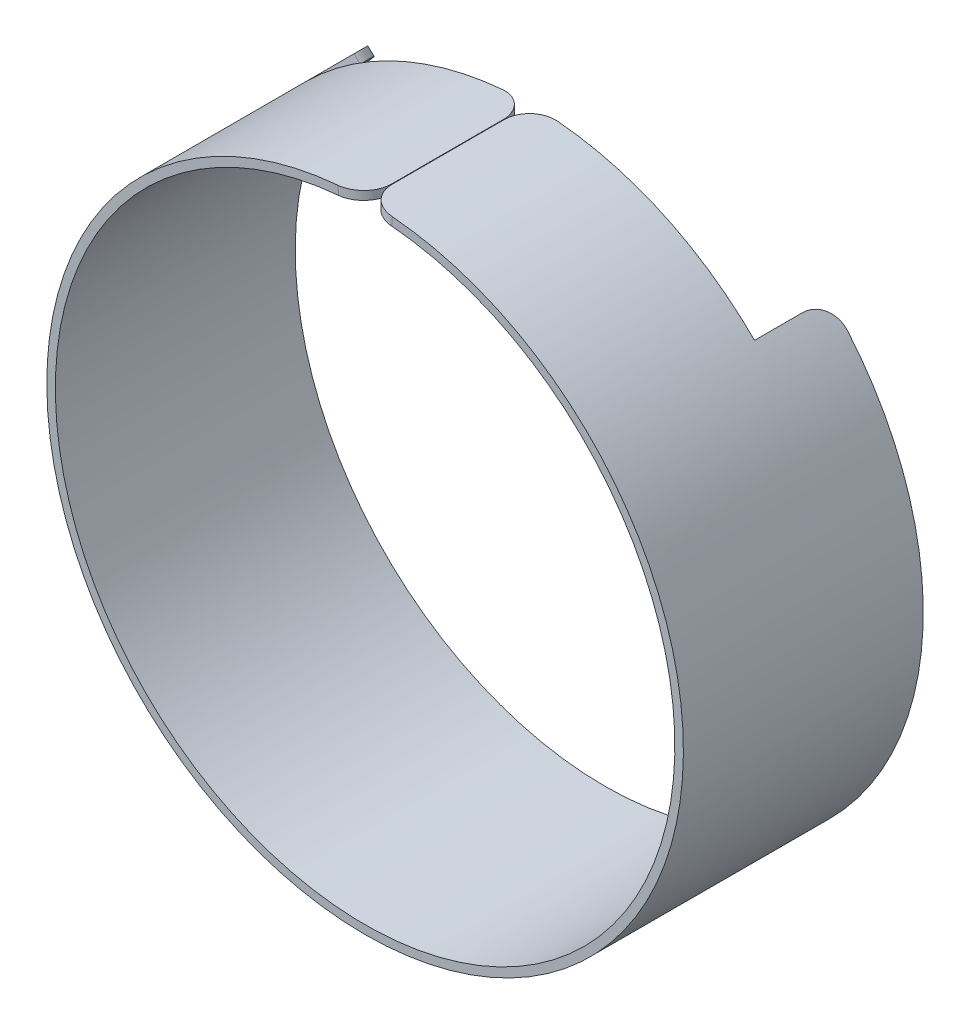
ISO-10303-21;
HEADER;
FILE_DESCRIPTION(('STEP AP214'),'2;1');
FILE_NAME('part.step','',(''),(''),'','','');
FILE_SCHEMA(('AUTOMOTIVE_DESIGN { 1 0 10303 214 1 1 1 1 }'));
ENDSEC;
DATA;
#1=APPLICATION_CONTEXT('core data for automotive mechanical design processes');
#2=APPLICATION_PROTOCOL_DEFINITION('international standard','automotive_design',2000,#1);
#3=PRODUCT_CONTEXT('',#1,'mechanical');
#4=PRODUCT('Part','Part','',(#3));
#5=PRODUCT_RELATED_PRODUCT_CATEGORY('part','',(#4));
#6=PRODUCT_DEFINITION_FORMATION('','',#4);
#7=PRODUCT_DEFINITION_CONTEXT('part definition',#1,'design');
#8=PRODUCT_DEFINITION('design','',#6,#7);
#9=PRODUCT_DEFINITION_SHAPE('','',#8);
#10=(LENGTH_UNIT() NAMED_UNIT(*) SI_UNIT(.MILLI.,.METRE.));
#11=(NAMED_UNIT(*) PLANE_ANGLE_UNIT() SI_UNIT($,.RADIAN.));
#12=(NAMED_UNIT(*) SI_UNIT($,.STERADIAN.) SOLID_ANGLE_UNIT());
#13=UNCERTAINTY_MEASURE_WITH_UNIT(LENGTH_MEASURE(1.E-05),#10,'distance_accuracy_value','');
#14=(GEOMETRIC_REPRESENTATION_CONTEXT(3) GLOBAL_UNCERTAINTY_ASSIGNED_CONTEXT((#13)) GLOBAL_UNIT_ASSIGNED_CONTEXT((#10,
#11,#12)) REPRESENTATION_CONTEXT('',''));
#15=CARTESIAN_POINT('',(0.,0.,0.));
#16=DIRECTION('',(0.,0.,1.));
#17=DIRECTION('',(1.,0.,0.));
#18=AXIS2_PLACEMENT_3D('',#15,#16,#17);
#19=CARTESIAN_POINT('',(-5.11163381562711,59.4930524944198,14.0000000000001));
#20=CARTESIAN_POINT('',(-4.45063932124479,59.5499569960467,13.9996877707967));
#21=CARTESIAN_POINT('',(-3.78914685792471,59.5950776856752,14.1300864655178));
#22=CARTESIAN_POINT('',(-2.56484583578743,59.6602582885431,14.6311182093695));
#23=CARTESIAN_POINT('',(-2.00313816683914,59.6805170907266,15.00160720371));
#24=CARTESIAN_POINT('',(-1.06522984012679,59.7045468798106,15.9273249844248));
#25=CARTESIAN_POINT('',(-0.689624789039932,59.7088278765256,16.4818419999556));
#26=CARTESIAN_POINT('',(-0.181908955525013,59.7124801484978,17.6913236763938));
#27=CARTESIAN_POINT('',(-0.0496176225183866,59.7121395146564,18.3451984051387));
#28=CARTESIAN_POINT('',(-0.0499999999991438,59.71222316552,19.0000000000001));
#29=CARTESIAN_POINT('',(-4.97466669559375,57.8989257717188,14.0000000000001));
#30=CARTESIAN_POINT('',(-4.33138366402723,57.9543055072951,13.9996877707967));
#31=CARTESIAN_POINT('',(-3.687616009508,57.9982171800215,14.1300864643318));
#32=CARTESIAN_POINT('',(-2.49612034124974,58.0616512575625,14.6311182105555));
#33=CARTESIAN_POINT('',(-1.94946373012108,58.0813672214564,15.0016072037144));
#34=CARTESIAN_POINT('',(-1.03668682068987,58.1047531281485,15.9273249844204));
#35=CARTESIAN_POINT('',(-0.671146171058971,58.10891941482,16.4818420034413));
#36=CARTESIAN_POINT('',(-0.177034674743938,58.1124738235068,17.691323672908));
#37=CARTESIAN_POINT('',(-0.048288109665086,58.1121423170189,18.3451984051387));
#38=CARTESIAN_POINT('',(-0.0486602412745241,58.112223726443,19.0000000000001));
#39=B_SPLINE_SURFACE_WITH_KNOTS('',1,3,((#19,#20,#21,#22,#23,#24,#25,#26,#27,#28),(#29,#30,#31,
#32,#33,#34,#35,#36,#37,#38)),.UNSPECIFIED.,.F.,.F.,.F.,(2,2),(4,2,2,2,4),(0.,1.),(0.,0.25,0.5,
0.75,1.),.UNSPECIFIED.);
#40=CARTESIAN_POINT('',(-0.0499999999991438,59.71222316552,19.0000000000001));
#41=CARTESIAN_POINT('',(-0.0486602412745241,58.112223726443,19.0000000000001));
#42=B_SPLINE_CURVE_WITH_KNOTS('',1,(#40,#41),.UNSPECIFIED.,.F.,.F.,(2,2),(0.,1.),.UNSPECIFIED.);
#43=CARTESIAN_POINT('',(-0.0486602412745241,58.112223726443,19.0000000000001));
#44=VERTEX_POINT('',#43);
#45=CARTESIAN_POINT('',(-0.0499999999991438,59.71222316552,19.0000000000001));
#46=VERTEX_POINT('',#45);
#47=EDGE_CURVE('E11',#44,#46,#42,.F.);
#48=CARTESIAN_POINT('',(-0.0486602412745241,58.112223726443,19.0000000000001));
#49=CARTESIAN_POINT('',(-0.048288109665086,58.1121423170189,18.3451984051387));
#50=CARTESIAN_POINT('',(-0.177034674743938,58.1124738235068,17.691323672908));
#51=CARTESIAN_POINT('',(-0.671146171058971,58.10891941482,16.4818420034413));
#52=CARTESIAN_POINT('',(-1.03668682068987,58.1047531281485,15.9273249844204));
#53=CARTESIAN_POINT('',(-1.94946373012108,58.0813672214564,15.0016072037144));
#54=CARTESIAN_POINT('',(-2.49612034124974,58.0616512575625,14.6311182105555));
#55=CARTESIAN_POINT('',(-3.687616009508,57.9982171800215,14.1300864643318));
#56=CARTESIAN_POINT('',(-4.33138366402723,57.9543055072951,13.9996877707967));
#57=CARTESIAN_POINT('',(-4.97466669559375,57.8989257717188,14.0000000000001));
#58=B_SPLINE_CURVE_WITH_KNOTS('',3,(#48,#49,#50,#51,#52,#53,#54,#55,#56,#57),.UNSPECIFIED.,.F.,
.F.,(4,2,2,2,4),(0.,0.25,0.5,0.75,1.),.UNSPECIFIED.);
#59=CARTESIAN_POINT('',(-4.97466669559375,57.8989257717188,14.0000000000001));
#60=VERTEX_POINT('',#59);
#61=EDGE_CURVE('E665',#60,#44,#58,.F.);
#62=CARTESIAN_POINT('',(-4.97466669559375,57.8989257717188,14.0000000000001));
#63=CARTESIAN_POINT('',(-5.11163381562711,59.4930524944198,14.0000000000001));
#64=B_SPLINE_CURVE_WITH_KNOTS('',1,(#62,#63),.UNSPECIFIED.,.F.,.F.,(2,2),(0.,1.),.UNSPECIFIED.);
#65=CARTESIAN_POINT('',(-5.11163381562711,59.4930524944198,14.0000000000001));
#66=VERTEX_POINT('',#65);
#67=EDGE_CURVE('E43',#60,#66,#64,.T.);
#68=CARTESIAN_POINT('',(-5.11163381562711,59.4930524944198,14.0000000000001));
#69=CARTESIAN_POINT('',(-4.45063932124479,59.5499569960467,13.9996877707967));
#70=CARTESIAN_POINT('',(-3.78914685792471,59.5950776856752,14.1300864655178));
#71=CARTESIAN_POINT('',(-2.56484583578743,59.6602582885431,14.6311182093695));
#72=CARTESIAN_POINT('',(-2.00313816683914,59.6805170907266,15.00160720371));
#73=CARTESIAN_POINT('',(-1.06522984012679,59.7045468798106,15.9273249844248));
#74=CARTESIAN_POINT('',(-0.689624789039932,59.7088278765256,16.4818419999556));
#75=CARTESIAN_POINT('',(-0.181908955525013,59.7124801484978,17.6913236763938));
#76=CARTESIAN_POINT('',(-0.0496176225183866,59.7121395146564,18.3451984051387));
#77=CARTESIAN_POINT('',(-0.0499999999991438,59.71222316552,19.0000000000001));
#78=B_SPLINE_CURVE_WITH_KNOTS('',3,(#68,#69,#70,#71,#72,#73,#74,#75,#76,#77),.UNSPECIFIED.,.F.,
.F.,(4,2,2,2,4),(0.,0.25,0.5,0.75,1.),.UNSPECIFIED.);
#79=EDGE_CURVE('E635',#66,#46,#78,.T.);
#80=ORIENTED_EDGE('',*,*,#47,.F.);
#81=ORIENTED_EDGE('',*,*,#61,.F.);
#82=ORIENTED_EDGE('',*,*,#67,.T.);
#83=ORIENTED_EDGE('',*,*,#79,.T.);
#84=EDGE_LOOP('',(#80,#81,#82,#83));
#85=FACE_BOUND('',#84,.T.);
#86=ADVANCED_FACE('F32',(#85),#39,.F.);
#87=CARTESIAN_POINT('',(0.,0.,14.0000000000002));
#88=DIRECTION('',(0.,0.,-1.));
#89=DIRECTION('',(-1.,0.,0.));
#90=AXIS2_PLACEMENT_3D('',#87,#88,#89);
#91=PLANE('',#90);
#92=ORIENTED_EDGE('',*,*,#67,.F.);
#93=CARTESIAN_POINT('',(0.,0.,14.0000000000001));
#94=DIRECTION('',(0.,0.,1.));
#95=DIRECTION('',(1.,0.,0.));
#96=AXIS2_PLACEMENT_3D('',#93,#94,#95);
#97=CIRCLE('',#96,58.1122440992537);
#98=CARTESIAN_POINT('',(-40.9376579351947,41.2448915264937,14.0000000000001));
#99=VERTEX_POINT('',#98);
#100=EDGE_CURVE('E237',#60,#99,#97,.T.);
#101=ORIENTED_EDGE('',*,*,#100,.T.);
#102=DIRECTION('',(-0.704458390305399,0.709745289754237,0.));
#103=VECTOR('',#102,1.);
#104=CARTESIAN_POINT('',(-41.5012246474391,41.8126877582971,14.0000000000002));
#105=LINE('',#104,#103);
#106=CARTESIAN_POINT('',(-42.0647913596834,42.3804839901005,14.0000000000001));
#107=VERTEX_POINT('',#106);
#108=EDGE_CURVE('E318',#99,#107,#105,.T.);
#109=ORIENTED_EDGE('',*,*,#108,.T.);
#110=CARTESIAN_POINT('',(0.,0.,14.0000000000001));
#111=DIRECTION('',(0.,0.,1.));
#112=DIRECTION('',(1.,0.,0.));
#113=AXIS2_PLACEMENT_3D('',#110,#111,#112);
#114=CIRCLE('',#113,59.7122440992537);
#115=EDGE_CURVE('E644',#66,#107,#114,.T.);
#116=ORIENTED_EDGE('',*,*,#115,.F.);
#117=EDGE_LOOP('',(#92,#101,#109,#116));
#118=FACE_BOUND('',#117,.T.);
#119=ADVANCED_FACE('F342',(#118),#91,.T.);
#120=CARTESIAN_POINT('',(-41.5012246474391,41.8126877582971,5.00000000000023));
#121=DIRECTION('',(-0.709745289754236,-0.7044583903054,0.));
#122=DIRECTION('',(0.,0.,1.));
#123=AXIS2_PLACEMENT_3D('',#120,#121,#122);
#124=PLANE('',#123);
#125=ORIENTED_EDGE('',*,*,#108,.F.);
#126=DIRECTION('',(0.,0.,1.));
#127=VECTOR('',#126,1.);
#128=CARTESIAN_POINT('',(-40.937657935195,41.2448915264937,-372.789997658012));
#129=LINE('',#128,#127);
#130=CARTESIAN_POINT('',(-40.9376579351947,41.2448915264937,5.));
#131=VERTEX_POINT('',#130);
#132=EDGE_CURVE('E235',#131,#99,#129,.T.);
#133=ORIENTED_EDGE('',*,*,#132,.F.);
#134=CARTESIAN_POINT('',(-42.0647913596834,42.3804839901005,5.00000000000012));
#135=CARTESIAN_POINT('',(-40.9376579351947,41.2448915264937,5.00000000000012));
#136=B_SPLINE_CURVE_WITH_KNOTS('',1,(#134,#135),.UNSPECIFIED.,.F.,.F.,(2,2),(0.,1.),.UNSPECIFIED.);
#137=CARTESIAN_POINT('',(-42.0647913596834,42.3804839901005,5.));
#138=VERTEX_POINT('',#137);
#139=EDGE_CURVE('E305',#131,#138,#136,.F.);
#140=ORIENTED_EDGE('',*,*,#139,.T.);
#141=DIRECTION('',(0.,0.,1.));
#142=VECTOR('',#141,1.);
#143=CARTESIAN_POINT('',(-42.0647913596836,42.3804839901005,-372.789997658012));
#144=LINE('',#143,#142);
#145=EDGE_CURVE('E646',#138,#107,#144,.T.);
#146=ORIENTED_EDGE('',*,*,#145,.T.);
#147=EDGE_LOOP('',(#125,#133,#140,#146));
#148=FACE_BOUND('',#147,.T.);
#149=ADVANCED_FACE('F262',(#148),#124,.F.);
#150=CARTESIAN_POINT('',(-45.5059802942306,38.6620984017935,1.11022302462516E-13));
#151=CARTESIAN_POINT('',(-45.0765058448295,39.1677697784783,-0.000312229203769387));
#152=CARTESIAN_POINT('',(-44.6383834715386,39.6654212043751,0.13008646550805));
#153=CARTESIAN_POINT('',(-43.814597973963,40.5734624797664,0.631118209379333));
#154=CARTESIAN_POINT('',(-43.4298568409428,40.9832187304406,1.00160720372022));
#155=CARTESIAN_POINT('',(-42.7805415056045,41.6604476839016,1.9273249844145));
#156=CARTESIAN_POINT('',(-42.5167493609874,41.9278634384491,2.48184199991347));
#157=CARTESIAN_POINT('',(-42.1586717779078,42.2878205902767,3.69132367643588));
#158=CARTESIAN_POINT('',(-42.0644608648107,42.3806937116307,4.34519840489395));
#159=CARTESIAN_POINT('',(-42.0647913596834,42.3804839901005,5.00000000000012));
#160=CARTESIAN_POINT('',(-44.2866396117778,37.6261407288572,1.11022302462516E-13));
#161=CARTESIAN_POINT('',(-43.8686730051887,38.1182625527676,-0.000312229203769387));
#162=CARTESIAN_POINT('',(-43.4422901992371,38.602579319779,0.130086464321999));
#163=CARTESIAN_POINT('',(-42.6405781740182,39.4862894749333,0.631118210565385));
#164=CARTESIAN_POINT('',(-42.2661462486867,39.8850662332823,1.00160720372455));
#165=CARTESIAN_POINT('',(-41.6342294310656,40.5441487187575,1.92732498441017));
#166=CARTESIAN_POINT('',(-41.3775056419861,40.8043990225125,2.48184200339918));
#167=CARTESIAN_POINT('',(-41.0290228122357,41.1547110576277,3.69132367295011));
#168=CARTESIAN_POINT('',(-40.9373362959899,41.2450956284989,4.34519840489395));
#169=CARTESIAN_POINT('',(-40.9376579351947,41.2448915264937,5.00000000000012));
#170=B_SPLINE_SURFACE_WITH_KNOTS('',1,3,((#150,#151,#152,#153,#154,#155,#156,#157,#158,#159),
(#160,#161,#162,#163,#164,#165,#166,#167,#168,#169)),.UNSPECIFIED.,.F.,.F.,.F.,(2,2),(4,2,2,2,
4),(0.,1.),(0.,0.25,0.5,0.75,1.),.UNSPECIFIED.);
#171=CARTESIAN_POINT('',(-40.9376579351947,41.2448915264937,5.00000000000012));
#172=CARTESIAN_POINT('',(-40.9373362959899,41.2450956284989,4.34519840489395));
#173=CARTESIAN_POINT('',(-41.0290228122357,41.1547110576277,3.69132367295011));
#174=CARTESIAN_POINT('',(-41.3775056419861,40.8043990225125,2.48184200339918));
#175=CARTESIAN_POINT('',(-41.6342294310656,40.5441487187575,1.92732498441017));
#176=CARTESIAN_POINT('',(-42.2661462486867,39.8850662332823,1.00160720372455));
#177=CARTESIAN_POINT('',(-42.6405781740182,39.4862894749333,0.631118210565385));
#178=CARTESIAN_POINT('',(-43.4422901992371,38.602579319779,0.130086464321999));
#179=CARTESIAN_POINT('',(-43.8686730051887,38.1182625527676,-0.000312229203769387));
#180=CARTESIAN_POINT('',(-44.2866396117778,37.6261407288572,1.11022302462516E-13));
#181=B_SPLINE_CURVE_WITH_KNOTS('',3,(#171,#172,#173,#174,#175,#176,#177,#178,#179,#180),
.UNSPECIFIED.,.F.,.F.,(4,2,2,2,4),(0.,0.25,0.5,0.75,1.),.UNSPECIFIED.);
#182=CARTESIAN_POINT('',(-44.2866396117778,37.6261407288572,1.11022302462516E-13));
#183=VERTEX_POINT('',#182);
#184=EDGE_CURVE('E232',#183,#131,#181,.F.);
#185=CARTESIAN_POINT('',(-44.2866396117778,37.6261407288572,1.11022302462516E-13));
#186=CARTESIAN_POINT('',(-45.5059802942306,38.6620984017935,1.11022302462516E-13));
#187=B_SPLINE_CURVE_WITH_KNOTS('',1,(#185,#186),.UNSPECIFIED.,.F.,.F.,(2,2),(0.,1.),.UNSPECIFIED.);
#188=CARTESIAN_POINT('',(-45.5059802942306,38.6620984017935,1.11022302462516E-13));
#189=VERTEX_POINT('',#188);
#190=EDGE_CURVE('E292',#183,#189,#187,.T.);
#191=CARTESIAN_POINT('',(-45.5059802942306,38.6620984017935,1.11022302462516E-13));
#192=CARTESIAN_POINT('',(-45.0765058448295,39.1677697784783,-0.000312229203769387));
#193=CARTESIAN_POINT('',(-44.6383834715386,39.6654212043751,0.13008646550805));
#194=CARTESIAN_POINT('',(-43.814597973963,40.5734624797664,0.631118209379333));
#195=CARTESIAN_POINT('',(-43.4298568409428,40.9832187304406,1.00160720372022));
#196=CARTESIAN_POINT('',(-42.7805415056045,41.6604476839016,1.9273249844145));
#197=CARTESIAN_POINT('',(-42.5167493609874,41.9278634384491,2.48184199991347));
#198=CARTESIAN_POINT('',(-42.1586717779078,42.2878205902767,3.69132367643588));
#199=CARTESIAN_POINT('',(-42.0644608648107,42.3806937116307,4.34519840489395));
#200=CARTESIAN_POINT('',(-42.0647913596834,42.3804839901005,5.00000000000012));
#201=B_SPLINE_CURVE_WITH_KNOTS('',3,(#191,#192,#193,#194,#195,#196,#197,#198,#199,#200),
.UNSPECIFIED.,.F.,.F.,(4,2,2,2,4),(0.,0.25,0.5,0.75,1.),.UNSPECIFIED.);
#202=EDGE_CURVE('E243',#189,#138,#201,.T.);
#203=ORIENTED_EDGE('',*,*,#139,.F.);
#204=ORIENTED_EDGE('',*,*,#184,.F.);
#205=ORIENTED_EDGE('',*,*,#190,.T.);
#206=ORIENTED_EDGE('',*,*,#202,.T.);
#207=EDGE_LOOP('',(#203,#204,#205,#206));
#208=FACE_BOUND('',#207,.T.);
#209=ADVANCED_FACE('F249',(#208),#170,.F.);
#210=CARTESIAN_POINT('',(0.,0.,0.));
#211=DIRECTION('',(0.,0.,1.));
#212=DIRECTION('',(0.,-1.,0.));
#213=AXIS2_PLACEMENT_3D('',#210,#211,#212);
#214=PLANE('',#213);
#215=ORIENTED_EDGE('',*,*,#190,.F.);
#216=CARTESIAN_POINT('',(0.,0.,-2.22044604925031E-13));
#217=DIRECTION('',(0.,0.,1.));
#218=DIRECTION('',(1.,0.,0.));
#219=AXIS2_PLACEMENT_3D('',#216,#217,#218);
#220=CIRCLE('',#219,58.1122440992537);
#221=CARTESIAN_POINT('',(44.2866396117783,37.6261407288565,-2.22044604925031E-13));
#222=VERTEX_POINT('',#221);
#223=EDGE_CURVE('E498',#222,#183,#220,.F.);
#224=ORIENTED_EDGE('',*,*,#223,.F.);
#225=CARTESIAN_POINT('',(45.5059802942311,38.6620984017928,-1.11022302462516E-13));
#226=CARTESIAN_POINT('',(44.2866396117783,37.6261407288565,-1.11022302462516E-13));
#227=B_SPLINE_CURVE_WITH_KNOTS('',1,(#225,#226),.UNSPECIFIED.,.F.,.F.,(2,2),(0.,1.),.UNSPECIFIED.);
#228=CARTESIAN_POINT('',(45.5059802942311,38.6620984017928,-2.22044604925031E-13));
#229=VERTEX_POINT('',#228);
#230=EDGE_CURVE('E471',#222,#229,#227,.F.);
#231=ORIENTED_EDGE('',*,*,#230,.T.);
#232=CARTESIAN_POINT('',(0.,0.,-2.22044604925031E-13));
#233=DIRECTION('',(0.,0.,1.));
#234=DIRECTION('',(1.,0.,0.));
#235=AXIS2_PLACEMENT_3D('',#232,#233,#234);
#236=CIRCLE('',#235,59.7122440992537);
#237=EDGE_CURVE('E517',#229,#189,#236,.F.);
#238=ORIENTED_EDGE('',*,*,#237,.T.);
#239=EDGE_LOOP('',(#215,#224,#231,#238));
#240=FACE_BOUND('',#239,.T.);
#241=ADVANCED_FACE('F261',(#240),#214,.F.);
#242=CARTESIAN_POINT('',(42.0647913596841,42.3804839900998,4.99999999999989));
#243=CARTESIAN_POINT('',(42.064506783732,42.3806473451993,4.34545300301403));
#244=CARTESIAN_POINT('',(42.1586360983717,42.2878578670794,3.69138498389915));
#245=CARTESIAN_POINT('',(42.5167850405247,41.9278261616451,2.4817806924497));
#246=CARTESIAN_POINT('',(42.7805184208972,41.6604748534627,1.92728984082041));
#247=CARTESIAN_POINT('',(43.4298799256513,40.9831915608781,1.00164234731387));
#248=CARTESIAN_POINT('',(43.8146404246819,40.5734170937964,0.631067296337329));
#249=CARTESIAN_POINT('',(44.6383410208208,39.6654665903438,0.130137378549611));
#250=CARTESIAN_POINT('',(45.0763422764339,39.167969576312,-0.000376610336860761));
#251=CARTESIAN_POINT('',(45.5059802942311,38.6620984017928,-1.11022302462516E-13));
#252=CARTESIAN_POINT('',(40.9376579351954,41.244891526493,4.99999999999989));
#253=CARTESIAN_POINT('',(40.9373809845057,41.2450505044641,4.34545300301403));
#254=CARTESIAN_POINT('',(41.0289880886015,41.1547473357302,3.69138498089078));
#255=CARTESIAN_POINT('',(41.3775403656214,40.8043627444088,2.48178069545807));
#256=CARTESIAN_POINT('',(41.6342069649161,40.5441751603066,1.92728984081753));
#257=CARTESIAN_POINT('',(42.2661687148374,39.8850397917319,1.00164234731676));
#258=CARTESIAN_POINT('',(42.6406194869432,39.4862453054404,0.631067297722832));
#259=CARTESIAN_POINT('',(43.4422488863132,38.6026234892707,0.130137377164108));
#260=CARTESIAN_POINT('',(43.8685138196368,38.1184569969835,-0.000376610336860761));
#261=CARTESIAN_POINT('',(44.2866396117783,37.6261407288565,-1.11022302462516E-13));
#262=B_SPLINE_SURFACE_WITH_KNOTS('',1,3,((#242,#243,#244,#245,#246,#247,#248,#249,#250,#251),
(#252,#253,#254,#255,#256,#257,#258,#259,#260,#261)),.UNSPECIFIED.,.F.,.F.,.F.,(2,2),(4,2,2,2,
4),(0.,1.),(0.,0.25,0.5,0.75,1.),.UNSPECIFIED.);
#263=CARTESIAN_POINT('',(44.2866396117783,37.6261407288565,-1.11022302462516E-13));
#264=CARTESIAN_POINT('',(43.8685138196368,38.1184569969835,-0.000376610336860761));
#265=CARTESIAN_POINT('',(43.4422488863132,38.6026234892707,0.130137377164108));
#266=CARTESIAN_POINT('',(42.6406194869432,39.4862453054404,0.631067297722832));
#267=CARTESIAN_POINT('',(42.2661687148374,39.8850397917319,1.00164234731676));
#268=CARTESIAN_POINT('',(41.6342069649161,40.5441751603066,1.92728984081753));
#269=CARTESIAN_POINT('',(41.3775403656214,40.8043627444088,2.48178069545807));
#270=CARTESIAN_POINT('',(41.0289880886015,41.1547473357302,3.69138498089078));
#271=CARTESIAN_POINT('',(40.9373809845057,41.2450505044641,4.34545300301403));
#272=CARTESIAN_POINT('',(40.9376579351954,41.244891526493,4.99999999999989));
#273=B_SPLINE_CURVE_WITH_KNOTS('',3,(#263,#264,#265,#266,#267,#268,#269,#270,#271,#272),
.UNSPECIFIED.,.F.,.F.,(4,2,2,2,4),(0.,0.25,0.5,0.75,1.),.UNSPECIFIED.);
#274=CARTESIAN_POINT('',(40.9376579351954,41.244891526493,4.99999999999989));
#275=VERTEX_POINT('',#274);
#276=EDGE_CURVE('E492',#275,#222,#273,.F.);
#277=CARTESIAN_POINT('',(40.9376579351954,41.244891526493,4.99999999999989));
#278=CARTESIAN_POINT('',(42.0647913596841,42.3804839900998,4.99999999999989));
#279=B_SPLINE_CURVE_WITH_KNOTS('',1,(#277,#278),.UNSPECIFIED.,.F.,.F.,(2,2),(0.,1.),.UNSPECIFIED.);
#280=CARTESIAN_POINT('',(42.0647913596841,42.3804839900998,4.99999999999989));
#281=VERTEX_POINT('',#280);
#282=EDGE_CURVE('E497',#275,#281,#279,.T.);
#283=CARTESIAN_POINT('',(42.0647913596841,42.3804839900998,4.99999999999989));
#284=CARTESIAN_POINT('',(42.064506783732,42.3806473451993,4.34545300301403));
#285=CARTESIAN_POINT('',(42.1586360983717,42.2878578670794,3.69138498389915));
#286=CARTESIAN_POINT('',(42.5167850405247,41.9278261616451,2.4817806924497));
#287=CARTESIAN_POINT('',(42.7805184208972,41.6604748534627,1.92728984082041));
#288=CARTESIAN_POINT('',(43.4298799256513,40.9831915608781,1.00164234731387));
#289=CARTESIAN_POINT('',(43.8146404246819,40.5734170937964,0.631067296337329));
#290=CARTESIAN_POINT('',(44.6383410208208,39.6654665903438,0.130137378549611));
#291=CARTESIAN_POINT('',(45.0763422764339,39.167969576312,-0.000376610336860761));
#292=CARTESIAN_POINT('',(45.5059802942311,38.6620984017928,-1.11022302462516E-13));
#293=B_SPLINE_CURVE_WITH_KNOTS('',3,(#283,#284,#285,#286,#287,#288,#289,#290,#291,#292),
.UNSPECIFIED.,.F.,.F.,(4,2,2,2,4),(0.,0.25,0.5,0.75,1.),.UNSPECIFIED.);
#294=EDGE_CURVE('E495',#281,#229,#293,.T.);
#295=ORIENTED_EDGE('',*,*,#230,.F.);
#296=ORIENTED_EDGE('',*,*,#276,.F.);
#297=ORIENTED_EDGE('',*,*,#282,.T.);
#298=ORIENTED_EDGE('',*,*,#294,.T.);
#299=EDGE_LOOP('',(#295,#296,#297,#298));
#300=FACE_BOUND('',#299,.T.);
#301=ADVANCED_FACE('F454',(#300),#262,.F.);
#302=CARTESIAN_POINT('',(41.5012246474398,41.8126877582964,5.));
#303=DIRECTION('',(-0.70974528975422,0.704458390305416,0.));
#304=DIRECTION('',(0.,0.,1.));
#305=AXIS2_PLACEMENT_3D('',#302,#303,#304);
#306=PLANE('',#305);
#307=ORIENTED_EDGE('',*,*,#282,.F.);
#308=DIRECTION('',(0.,0.,1.));
#309=VECTOR('',#308,1.);
#310=CARTESIAN_POINT('',(40.9376579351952,41.244891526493,-372.789997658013));
#311=LINE('',#310,#309);
#312=CARTESIAN_POINT('',(40.9376579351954,41.244891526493,13.9999999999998));
#313=VERTEX_POINT('',#312);
#314=EDGE_CURVE('E503',#275,#313,#311,.T.);
#315=ORIENTED_EDGE('',*,*,#314,.T.);
#316=DIRECTION('',(0.704458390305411,0.709745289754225,0.));
#317=VECTOR('',#316,1.);
#318=CARTESIAN_POINT('',(41.5012246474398,41.8126877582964,14.));
#319=LINE('',#318,#317);
#320=CARTESIAN_POINT('',(42.0647913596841,42.3804839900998,13.9999999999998));
#321=VERTEX_POINT('',#320);
#322=EDGE_CURVE('E598',#313,#321,#319,.T.);
#323=ORIENTED_EDGE('',*,*,#322,.T.);
#324=DIRECTION('',(0.,0.,1.));
#325=VECTOR('',#324,1.);
#326=CARTESIAN_POINT('',(42.0647913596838,42.3804839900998,-372.789997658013));
#327=LINE('',#326,#325);
#328=EDGE_CURVE('E533',#281,#321,#327,.T.);
#329=ORIENTED_EDGE('',*,*,#328,.F.);
#330=EDGE_LOOP('',(#307,#315,#323,#329));
#331=FACE_BOUND('',#330,.T.);
#332=ADVANCED_FACE('F451',(#331),#306,.T.);
#333=CARTESIAN_POINT('',(0.,0.,14.));
#334=DIRECTION('',(0.,0.,1.));
#335=DIRECTION('',(1.,0.,0.));
#336=AXIS2_PLACEMENT_3D('',#333,#334,#335);
#337=PLANE('',#336);
#338=ORIENTED_EDGE('',*,*,#322,.F.);
#339=CARTESIAN_POINT('',(0.,0.,13.9999999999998));
#340=DIRECTION('',(0.,0.,1.));
#341=DIRECTION('',(1.,0.,0.));
#342=AXIS2_PLACEMENT_3D('',#339,#340,#341);
#343=CIRCLE('',#342,58.1122440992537);
#344=CARTESIAN_POINT('',(4.97466669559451,57.8989257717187,13.9999999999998));
#345=VERTEX_POINT('',#344);
#346=EDGE_CURVE('E537',#345,#313,#343,.F.);
#347=ORIENTED_EDGE('',*,*,#346,.F.);
#348=CARTESIAN_POINT('',(5.11163381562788,59.4930524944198,13.9999999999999));
#349=CARTESIAN_POINT('',(4.97466669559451,57.8989257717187,13.9999999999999));
#350=B_SPLINE_CURVE_WITH_KNOTS('',1,(#348,#349),.UNSPECIFIED.,.F.,.F.,(2,2),(0.,1.),.UNSPECIFIED.);
#351=CARTESIAN_POINT('',(5.11163381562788,59.4930524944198,13.9999999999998));
#352=VERTEX_POINT('',#351);
#353=EDGE_CURVE('E436',#345,#352,#350,.F.);
#354=ORIENTED_EDGE('',*,*,#353,.T.);
#355=CARTESIAN_POINT('',(0.,0.,13.9999999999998));
#356=DIRECTION('',(0.,0.,1.));
#357=DIRECTION('',(1.,0.,0.));
#358=AXIS2_PLACEMENT_3D('',#355,#356,#357);
#359=CIRCLE('',#358,59.7122440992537);
#360=EDGE_CURVE('E535',#352,#321,#359,.F.);
#361=ORIENTED_EDGE('',*,*,#360,.T.);
#362=EDGE_LOOP('',(#338,#347,#354,#361));
#363=FACE_BOUND('',#362,.T.);
#364=ADVANCED_FACE('F442',(#363),#337,.F.);
#365=CARTESIAN_POINT('',(0.050000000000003,59.71222316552,18.9999999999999));
#366=CARTESIAN_POINT('',(0.0496828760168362,59.7121388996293,18.3454530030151));
#367=CARTESIAN_POINT('',(0.181857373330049,59.7124815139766,17.6913849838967));
#368=CARTESIAN_POINT('',(0.68967637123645,59.7088265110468,16.4817806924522));
#369=CARTESIAN_POINT('',(1.06519431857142,59.7045499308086,15.9272898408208));
#370=CARTESIAN_POINT('',(2.003173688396,59.6805140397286,15.0016423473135));
#371=CARTESIAN_POINT('',(2.5649079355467,59.66025592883,14.6310672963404));
#372=CARTESIAN_POINT('',(3.78908475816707,59.5950800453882,14.1301373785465));
#373=CARTESIAN_POINT('',(4.45038250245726,59.5499837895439,13.9996233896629));
#374=CARTESIAN_POINT('',(5.11163381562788,59.4930524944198,13.9999999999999));
#375=CARTESIAN_POINT('',(0.048660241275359,58.112223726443,18.9999999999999));
#376=CARTESIAN_POINT('',(0.0483516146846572,58.1121417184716,18.3454530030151));
#377=CARTESIAN_POINT('',(0.176984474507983,58.1124751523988,17.6913849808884));
#378=CARTESIAN_POINT('',(0.671196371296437,58.108918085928,16.4817806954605));
#379=CARTESIAN_POINT('',(1.03665225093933,58.1047560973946,15.9272898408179));
#380=CARTESIAN_POINT('',(1.94949829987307,58.0813642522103,15.0016423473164));
#381=CARTESIAN_POINT('',(2.49618077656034,58.0616489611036,14.631067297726));
#382=CARTESIAN_POINT('',(3.68755557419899,57.9982194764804,14.1301373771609));
#383=CARTESIAN_POINT('',(4.33113372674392,57.9543315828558,13.9996233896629));
#384=CARTESIAN_POINT('',(4.97466669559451,57.8989257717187,13.9999999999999));
#385=B_SPLINE_SURFACE_WITH_KNOTS('',1,3,((#365,#366,#367,#368,#369,#370,#371,#372,#373,#374),
(#375,#376,#377,#378,#379,#380,#381,#382,#383,#384)),.UNSPECIFIED.,.F.,.F.,.F.,(2,2),(4,2,2,2,
4),(0.,1.),(0.,0.25,0.5,0.75,1.),.UNSPECIFIED.);
#386=CARTESIAN_POINT('',(4.97466669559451,57.8989257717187,13.9999999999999));
#387=CARTESIAN_POINT('',(4.33113372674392,57.9543315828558,13.9996233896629));
#388=CARTESIAN_POINT('',(3.68755557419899,57.9982194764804,14.1301373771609));
#389=CARTESIAN_POINT('',(2.49618077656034,58.0616489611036,14.631067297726));
#390=CARTESIAN_POINT('',(1.94949829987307,58.0813642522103,15.0016423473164));
#391=CARTESIAN_POINT('',(1.03665225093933,58.1047560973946,15.9272898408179));
#392=CARTESIAN_POINT('',(0.671196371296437,58.108918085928,16.4817806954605));
#393=CARTESIAN_POINT('',(0.176984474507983,58.1124751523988,17.6913849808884));
#394=CARTESIAN_POINT('',(0.0483516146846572,58.1121417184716,18.3454530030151));
#395=CARTESIAN_POINT('',(0.048660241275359,58.112223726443,18.9999999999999));
#396=B_SPLINE_CURVE_WITH_KNOTS('',3,(#386,#387,#388,#389,#390,#391,#392,#393,#394,#395),
.UNSPECIFIED.,.F.,.F.,(4,2,2,2,4),(0.,0.25,0.5,0.75,1.),.UNSPECIFIED.);
#397=CARTESIAN_POINT('',(0.048660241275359,58.112223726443,18.9999999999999));
#398=VERTEX_POINT('',#397);
#399=EDGE_CURVE('E538',#398,#345,#396,.F.);
#400=CARTESIAN_POINT('',(0.048660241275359,58.112223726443,18.9999999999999));
#401=CARTESIAN_POINT('',(0.050000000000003,59.71222316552,18.9999999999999));
#402=B_SPLINE_CURVE_WITH_KNOTS('',1,(#400,#401),.UNSPECIFIED.,.F.,.F.,(2,2),(0.,1.),.UNSPECIFIED.);
#403=CARTESIAN_POINT('',(0.050000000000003,59.71222316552,18.9999999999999));
#404=VERTEX_POINT('',#403);
#405=EDGE_CURVE('E569',#398,#404,#402,.T.);
#406=CARTESIAN_POINT('',(0.050000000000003,59.71222316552,18.9999999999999));
#407=CARTESIAN_POINT('',(0.0496828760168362,59.7121388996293,18.3454530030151));
#408=CARTESIAN_POINT('',(0.181857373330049,59.7124815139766,17.6913849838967));
#409=CARTESIAN_POINT('',(0.68967637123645,59.7088265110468,16.4817806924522));
#410=CARTESIAN_POINT('',(1.06519431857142,59.7045499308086,15.9272898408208));
#411=CARTESIAN_POINT('',(2.003173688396,59.6805140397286,15.0016423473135));
#412=CARTESIAN_POINT('',(2.5649079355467,59.66025592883,14.6310672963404));
#413=CARTESIAN_POINT('',(3.78908475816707,59.5950800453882,14.1301373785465));
#414=CARTESIAN_POINT('',(4.45038250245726,59.5499837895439,13.9996233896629));
#415=CARTESIAN_POINT('',(5.11163381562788,59.4930524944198,13.9999999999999));
#416=B_SPLINE_CURVE_WITH_KNOTS('',3,(#406,#407,#408,#409,#410,#411,#412,#413,#414,#415),
.UNSPECIFIED.,.F.,.F.,(4,2,2,2,4),(0.,0.25,0.5,0.75,1.),.UNSPECIFIED.);
#417=EDGE_CURVE('E551',#404,#352,#416,.T.);
#418=ORIENTED_EDGE('',*,*,#353,.F.);
#419=ORIENTED_EDGE('',*,*,#399,.F.);
#420=ORIENTED_EDGE('',*,*,#405,.T.);
#421=ORIENTED_EDGE('',*,*,#417,.T.);
#422=EDGE_LOOP('',(#418,#419,#420,#421));
#423=FACE_BOUND('',#422,.T.);
#424=ADVANCED_FACE('F415',(#423),#385,.F.);
#425=CARTESIAN_POINT('',(0.0493301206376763,58.9122234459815,40.));
#426=DIRECTION('',(0.999999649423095,-0.000837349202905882,0.));
#427=DIRECTION('',(0.,0.,-1.));
#428=AXIS2_PLACEMENT_3D('',#425,#426,#427);
#429=PLANE('',#428);
#430=ORIENTED_EDGE('',*,*,#405,.F.);
#431=DIRECTION('',(0.,0.,1.));
#432=VECTOR('',#431,1.);
#433=CARTESIAN_POINT('',(0.0486602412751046,58.112223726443,-372.789997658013));
#434=LINE('',#433,#432);
#435=CARTESIAN_POINT('',(0.0486602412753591,58.112223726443,39.9999999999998));
#436=VERTEX_POINT('',#435);
#437=EDGE_CURVE('E541',#436,#398,#434,.F.);
#438=ORIENTED_EDGE('',*,*,#437,.F.);
#439=CARTESIAN_POINT('',(0.0500000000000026,59.71222316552,39.9999999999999));
#440=CARTESIAN_POINT('',(0.0486602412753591,58.112223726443,39.9999999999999));
#441=B_SPLINE_CURVE_WITH_KNOTS('',1,(#439,#440),.UNSPECIFIED.,.F.,.F.,(2,2),(0.,1.),.UNSPECIFIED.);
#442=CARTESIAN_POINT('',(0.0500000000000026,59.71222316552,39.9999999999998));
#443=VERTEX_POINT('',#442);
#444=EDGE_CURVE('E400',#436,#443,#441,.F.);
#445=ORIENTED_EDGE('',*,*,#444,.T.);
#446=DIRECTION('',(0.,0.,1.));
#447=VECTOR('',#446,1.);
#448=CARTESIAN_POINT('',(0.049999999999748,59.71222316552,-372.789997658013));
#449=LINE('',#448,#447);
#450=EDGE_CURVE('E611',#443,#404,#449,.F.);
#451=ORIENTED_EDGE('',*,*,#450,.T.);
#452=EDGE_LOOP('',(#430,#438,#445,#451));
#453=FACE_BOUND('',#452,.T.);
#454=ADVANCED_FACE('F406',(#453),#429,.F.);
#455=CARTESIAN_POINT('',(5.11163381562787,59.4930524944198,44.9999999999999));
#456=CARTESIAN_POINT('',(4.45063932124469,59.5499569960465,45.0003122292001));
#457=CARTESIAN_POINT('',(3.78914685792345,59.5950776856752,44.8699135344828));
#458=CARTESIAN_POINT('',(2.5648458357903,59.660258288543,44.3688817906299));
#459=CARTESIAN_POINT('',(2.00313816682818,59.6805170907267,43.9983927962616));
#460=CARTESIAN_POINT('',(1.06522984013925,59.7045468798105,43.0726750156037));
#461=CARTESIAN_POINT('',(0.689624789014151,59.7088278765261,42.5181580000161));
#462=CARTESIAN_POINT('',(0.181908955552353,59.7124801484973,41.3086763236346));
#463=CARTESIAN_POINT('',(0.0496176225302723,59.7121395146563,40.654801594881));
#464=CARTESIAN_POINT('',(0.0500000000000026,59.71222316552,39.9999999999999));
#465=CARTESIAN_POINT('',(4.9746666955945,57.8989257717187,44.9999999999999));
#466=CARTESIAN_POINT('',(4.33138366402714,57.9543055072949,45.0003122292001));
#467=CARTESIAN_POINT('',(3.68761600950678,57.9982171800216,44.8699135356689));
#468=CARTESIAN_POINT('',(2.49612034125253,58.0616512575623,44.3688817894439));
#469=CARTESIAN_POINT('',(1.94946373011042,58.0813672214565,43.9983927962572));
#470=CARTESIAN_POINT('',(1.03668682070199,58.1047531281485,43.0726750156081));
#471=CARTESIAN_POINT('',(0.671146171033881,58.1089194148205,42.5181579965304));
#472=CARTESIAN_POINT('',(0.177034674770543,58.1124738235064,41.3086763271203));
#473=CARTESIAN_POINT('',(0.0482881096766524,58.1121423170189,40.654801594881));
#474=CARTESIAN_POINT('',(0.0486602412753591,58.112223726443,39.9999999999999));
#475=B_SPLINE_SURFACE_WITH_KNOTS('',1,3,((#455,#456,#457,#458,#459,#460,#461,#462,#463,#464),
(#465,#466,#467,#468,#469,#470,#471,#472,#473,#474)),.UNSPECIFIED.,.F.,.F.,.F.,(2,2),(4,2,2,2,
4),(0.,1.),(0.,0.25,0.5,0.75,1.),.UNSPECIFIED.);
#476=CARTESIAN_POINT('',(0.0486602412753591,58.112223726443,39.9999999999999));
#477=CARTESIAN_POINT('',(0.0482881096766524,58.1121423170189,40.654801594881));
#478=CARTESIAN_POINT('',(0.177034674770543,58.1124738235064,41.3086763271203));
#479=CARTESIAN_POINT('',(0.671146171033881,58.1089194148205,42.5181579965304));
#480=CARTESIAN_POINT('',(1.03668682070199,58.1047531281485,43.0726750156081));
#481=CARTESIAN_POINT('',(1.94946373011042,58.0813672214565,43.9983927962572));
#482=CARTESIAN_POINT('',(2.49612034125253,58.0616512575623,44.3688817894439));
#483=CARTESIAN_POINT('',(3.68761600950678,57.9982171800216,44.8699135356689));
#484=CARTESIAN_POINT('',(4.33138366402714,57.9543055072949,45.0003122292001));
#485=CARTESIAN_POINT('',(4.9746666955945,57.8989257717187,44.9999999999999));
#486=B_SPLINE_CURVE_WITH_KNOTS('',3,(#476,#477,#478,#479,#480,#481,#482,#483,#484,#485),
.UNSPECIFIED.,.F.,.F.,(4,2,2,2,4),(0.,0.25,0.5,0.75,1.),.UNSPECIFIED.);
#487=CARTESIAN_POINT('',(4.9746666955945,57.8989257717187,44.9999999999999));
#488=VERTEX_POINT('',#487);
#489=EDGE_CURVE('E159',#488,#436,#486,.F.);
#490=CARTESIAN_POINT('',(4.9746666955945,57.8989257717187,44.9999999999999));
#491=CARTESIAN_POINT('',(5.11163381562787,59.4930524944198,44.9999999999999));
#492=B_SPLINE_CURVE_WITH_KNOTS('',1,(#490,#491),.UNSPECIFIED.,.F.,.F.,(2,2),(0.,1.),.UNSPECIFIED.);
#493=CARTESIAN_POINT('',(5.11163381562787,59.4930524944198,44.9999999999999));
#494=VERTEX_POINT('',#493);
#495=EDGE_CURVE('E149',#488,#494,#492,.T.);
#496=CARTESIAN_POINT('',(5.11163381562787,59.4930524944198,44.9999999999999));
#497=CARTESIAN_POINT('',(4.45063932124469,59.5499569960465,45.0003122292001));
#498=CARTESIAN_POINT('',(3.78914685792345,59.5950776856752,44.8699135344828));
#499=CARTESIAN_POINT('',(2.5648458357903,59.660258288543,44.3688817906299));
#500=CARTESIAN_POINT('',(2.00313816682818,59.6805170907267,43.9983927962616));
#501=CARTESIAN_POINT('',(1.06522984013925,59.7045468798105,43.0726750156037));
#502=CARTESIAN_POINT('',(0.689624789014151,59.7088278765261,42.5181580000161));
#503=CARTESIAN_POINT('',(0.181908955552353,59.7124801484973,41.3086763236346));
#504=CARTESIAN_POINT('',(0.0496176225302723,59.7121395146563,40.654801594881));
#505=CARTESIAN_POINT('',(0.0500000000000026,59.71222316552,39.9999999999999));
#506=B_SPLINE_CURVE_WITH_KNOTS('',3,(#496,#497,#498,#499,#500,#501,#502,#503,#504,#505),
.UNSPECIFIED.,.F.,.F.,(4,2,2,2,4),(0.,0.25,0.5,0.75,1.),.UNSPECIFIED.);
#507=EDGE_CURVE('E581',#494,#443,#506,.T.);
#508=ORIENTED_EDGE('',*,*,#444,.F.);
#509=ORIENTED_EDGE('',*,*,#489,.F.);
#510=ORIENTED_EDGE('',*,*,#495,.T.);
#511=ORIENTED_EDGE('',*,*,#507,.T.);
#512=EDGE_LOOP('',(#508,#509,#510,#511));
#513=FACE_BOUND('',#512,.T.);
#514=ADVANCED_FACE('F377',(#513),#475,.F.);
#515=CARTESIAN_POINT('',(0.,0.,45.0000000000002));
#516=DIRECTION('',(0.,0.,-1.));
#517=DIRECTION('',(0.,1.,0.));
#518=AXIS2_PLACEMENT_3D('',#515,#516,#517);
#519=PLANE('',#518);
#520=ORIENTED_EDGE('',*,*,#495,.F.);
#521=CARTESIAN_POINT('',(0.,0.,45.0000000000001));
#522=DIRECTION('',(0.,0.,1.));
#523=DIRECTION('',(1.,0.,0.));
#524=AXIS2_PLACEMENT_3D('',#521,#522,#523);
#525=CIRCLE('',#524,58.1122440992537);
#526=CARTESIAN_POINT('',(-4.97466669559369,57.8989257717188,45.0000000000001));
#527=VERTEX_POINT('',#526);
#528=EDGE_CURVE('E153',#527,#488,#525,.T.);
#529=ORIENTED_EDGE('',*,*,#528,.F.);
#530=CARTESIAN_POINT('',(-5.11163381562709,59.4930524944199,45.0000000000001));
#531=CARTESIAN_POINT('',(-4.97466669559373,57.8989257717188,45.0000000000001));
#532=B_SPLINE_CURVE_WITH_KNOTS('',1,(#530,#531),.UNSPECIFIED.,.F.,.F.,(2,2),(0.,1.),.UNSPECIFIED.);
#533=CARTESIAN_POINT('',(-5.11163381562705,59.4930524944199,45.0000000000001));
#534=VERTEX_POINT('',#533);
#535=EDGE_CURVE('E135',#527,#534,#532,.F.);
#536=ORIENTED_EDGE('',*,*,#535,.T.);
#537=CARTESIAN_POINT('',(0.,0.,45.0000000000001));
#538=DIRECTION('',(0.,0.,1.));
#539=DIRECTION('',(1.,0.,0.));
#540=AXIS2_PLACEMENT_3D('',#537,#538,#539);
#541=CIRCLE('',#540,59.7122440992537);
#542=EDGE_CURVE('E165',#534,#494,#541,.T.);
#543=ORIENTED_EDGE('',*,*,#542,.T.);
#544=EDGE_LOOP('',(#520,#529,#536,#543));
#545=FACE_BOUND('',#544,.T.);
#546=ADVANCED_FACE('F154',(#545),#519,.F.);
#547=CARTESIAN_POINT('',(-0.0499999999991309,59.71222316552,40.0000000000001));
#548=CARTESIAN_POINT('',(-0.0496828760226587,59.7121388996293,40.6545469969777));
#549=CARTESIAN_POINT('',(-0.181857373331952,59.7124815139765,41.3086150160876));
#550=CARTESIAN_POINT('',(-0.689676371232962,59.708826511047,42.5182193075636));
#551=CARTESIAN_POINT('',(-1.06519431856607,59.7045499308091,43.07271015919));
#552=CARTESIAN_POINT('',(-2.00317368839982,59.6805140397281,43.9983576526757));
#553=CARTESIAN_POINT('',(-2.5649079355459,59.6602559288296,44.3689327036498));
#554=CARTESIAN_POINT('',(-3.78908475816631,59.5950800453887,44.8698626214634));
#555=CARTESIAN_POINT('',(-4.45038250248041,59.5499837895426,45.000376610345));
#556=CARTESIAN_POINT('',(-5.11163381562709,59.4930524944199,45.0000000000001));
#557=CARTESIAN_POINT('',(-0.0486602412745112,58.112223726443,40.0000000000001));
#558=CARTESIAN_POINT('',(-0.0483516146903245,58.1121417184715,40.6545469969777));
#559=CARTESIAN_POINT('',(-0.176984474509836,58.1124751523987,41.3086150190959));
#560=CARTESIAN_POINT('',(-0.671196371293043,58.1089180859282,42.5182193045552));
#561=CARTESIAN_POINT('',(-1.03665225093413,58.1047560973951,43.0727101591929));
#562=CARTESIAN_POINT('',(-1.94949829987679,58.0813642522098,43.9983576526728));
#563=CARTESIAN_POINT('',(-2.49618077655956,58.0616489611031,44.3689327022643));
#564=CARTESIAN_POINT('',(-3.68755557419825,57.9982194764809,44.8698626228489));
#565=CARTESIAN_POINT('',(-4.33113372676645,57.9543315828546,45.000376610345));
#566=CARTESIAN_POINT('',(-4.97466669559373,57.8989257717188,45.0000000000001));
#567=B_SPLINE_SURFACE_WITH_KNOTS('',1,3,((#547,#548,#549,#550,#551,#552,#553,#554,#555,#556),
(#557,#558,#559,#560,#561,#562,#563,#564,#565,#566)),.UNSPECIFIED.,.F.,.F.,.F.,(2,2),(4,2,2,2,
4),(0.,1.),(0.,0.25,0.5,0.75,1.),.UNSPECIFIED.);
#568=CARTESIAN_POINT('',(-4.97466669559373,57.8989257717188,45.0000000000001));
#569=CARTESIAN_POINT('',(-4.33113372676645,57.9543315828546,45.000376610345));
#570=CARTESIAN_POINT('',(-3.68755557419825,57.9982194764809,44.8698626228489));
#571=CARTESIAN_POINT('',(-2.49618077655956,58.0616489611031,44.3689327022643));
#572=CARTESIAN_POINT('',(-1.94949829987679,58.0813642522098,43.9983576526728));
#573=CARTESIAN_POINT('',(-1.03665225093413,58.1047560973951,43.0727101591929));
#574=CARTESIAN_POINT('',(-0.671196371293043,58.1089180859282,42.5182193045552));
#575=CARTESIAN_POINT('',(-0.176984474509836,58.1124751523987,41.3086150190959));
#576=CARTESIAN_POINT('',(-0.0483516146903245,58.1121417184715,40.6545469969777));
#577=CARTESIAN_POINT('',(-0.0486602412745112,58.112223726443,40.0000000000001));
#578=B_SPLINE_CURVE_WITH_KNOTS('',3,(#568,#569,#570,#571,#572,#573,#574,#575,#576,#577),
.UNSPECIFIED.,.F.,.F.,(4,2,2,2,4),(0.,0.25,0.5,0.75,1.),.UNSPECIFIED.);
#579=CARTESIAN_POINT('',(-0.0486602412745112,58.112223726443,40.0000000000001));
#580=VERTEX_POINT('',#579);
#581=EDGE_CURVE('E140',#580,#527,#578,.F.);
#582=CARTESIAN_POINT('',(-0.0486602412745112,58.112223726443,40.0000000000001));
#583=CARTESIAN_POINT('',(-0.0499999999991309,59.71222316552,40.0000000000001));
#584=B_SPLINE_CURVE_WITH_KNOTS('',1,(#582,#583),.UNSPECIFIED.,.F.,.F.,(2,2),(0.,1.),.UNSPECIFIED.);
#585=CARTESIAN_POINT('',(-0.0499999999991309,59.71222316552,40.0000000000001));
#586=VERTEX_POINT('',#585);
#587=EDGE_CURVE('E50',#580,#586,#584,.T.);
#588=CARTESIAN_POINT('',(-0.0499999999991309,59.71222316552,40.0000000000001));
#589=CARTESIAN_POINT('',(-0.0496828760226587,59.7121388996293,40.6545469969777));
#590=CARTESIAN_POINT('',(-0.181857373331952,59.7124815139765,41.3086150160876));
#591=CARTESIAN_POINT('',(-0.689676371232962,59.708826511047,42.5182193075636));
#592=CARTESIAN_POINT('',(-1.06519431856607,59.7045499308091,43.07271015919));
#593=CARTESIAN_POINT('',(-2.00317368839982,59.6805140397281,43.9983576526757));
#594=CARTESIAN_POINT('',(-2.5649079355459,59.6602559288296,44.3689327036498));
#595=CARTESIAN_POINT('',(-3.78908475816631,59.5950800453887,44.8698626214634));
#596=CARTESIAN_POINT('',(-4.45038250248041,59.5499837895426,45.000376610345));
#597=CARTESIAN_POINT('',(-5.11163381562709,59.4930524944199,45.0000000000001));
#598=B_SPLINE_CURVE_WITH_KNOTS('',3,(#588,#589,#590,#591,#592,#593,#594,#595,#596,#597),
.UNSPECIFIED.,.F.,.F.,(4,2,2,2,4),(0.,0.25,0.5,0.75,1.),.UNSPECIFIED.);
#599=EDGE_CURVE('E143',#586,#534,#598,.T.);
#600=ORIENTED_EDGE('',*,*,#535,.F.);
#601=ORIENTED_EDGE('',*,*,#581,.F.);
#602=ORIENTED_EDGE('',*,*,#587,.T.);
#603=ORIENTED_EDGE('',*,*,#599,.T.);
#604=EDGE_LOOP('',(#600,#601,#602,#603));
#605=FACE_BOUND('',#604,.T.);
#606=ADVANCED_FACE('F138',(#605),#567,.F.);
#607=CARTESIAN_POINT('',(-0.0493301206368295,58.9122234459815,19.0000000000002));
#608=DIRECTION('',(-0.999999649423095,-0.00083734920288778,0.));
#609=DIRECTION('',(0.,0.,1.));
#610=AXIS2_PLACEMENT_3D('',#607,#608,#609);
#611=PLANE('',#610);
#612=DIRECTION('',(0.,0.,1.));
#613=VECTOR('',#612,1.);
#614=CARTESIAN_POINT('',(-0.0486602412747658,58.112223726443,-372.789997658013));
#615=LINE('',#614,#613);
#616=EDGE_CURVE('E164',#44,#580,#615,.T.);
#617=ORIENTED_EDGE('',*,*,#616,.F.);
#618=ORIENTED_EDGE('',*,*,#47,.T.);
#619=DIRECTION('',(0.,0.,1.));
#620=VECTOR('',#619,1.);
#621=CARTESIAN_POINT('',(-0.0499999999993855,59.71222316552,-372.789997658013));
#622=LINE('',#621,#620);
#623=EDGE_CURVE('E634',#46,#586,#622,.T.);
#624=ORIENTED_EDGE('',*,*,#623,.T.);
#625=ORIENTED_EDGE('',*,*,#587,.F.);
#626=EDGE_LOOP('',(#617,#618,#624,#625));
#627=FACE_BOUND('',#626,.T.);
#628=ADVANCED_FACE('F34',(#627),#611,.F.);
#629=CARTESIAN_POINT('',(-2.63190077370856E-13,0.,-372.789997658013));
#630=DIRECTION('',(0.,0.,1.));
#631=DIRECTION('',(1.,0.,0.));
#632=AXIS2_PLACEMENT_3D('',#629,#630,#631);
#633=CYLINDRICAL_SURFACE('',#632,59.7122440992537);
#634=ORIENTED_EDGE('',*,*,#599,.F.);
#635=ORIENTED_EDGE('',*,*,#623,.F.);
#636=ORIENTED_EDGE('',*,*,#79,.F.);
#637=ORIENTED_EDGE('',*,*,#115,.T.);
#638=ORIENTED_EDGE('',*,*,#145,.F.);
#639=ORIENTED_EDGE('',*,*,#202,.F.);
#640=ORIENTED_EDGE('',*,*,#237,.F.);
#641=ORIENTED_EDGE('',*,*,#294,.F.);
#642=ORIENTED_EDGE('',*,*,#328,.T.);
#643=ORIENTED_EDGE('',*,*,#360,.F.);
#644=ORIENTED_EDGE('',*,*,#417,.F.);
#645=ORIENTED_EDGE('',*,*,#450,.F.);
#646=ORIENTED_EDGE('',*,*,#507,.F.);
#647=ORIENTED_EDGE('',*,*,#542,.F.);
#648=EDGE_LOOP('',(#634,#635,#636,#637,#638,#639,#640,#641,#642,#643,#644,#645,#646,#647));
#649=FACE_BOUND('',#648,.T.);
#650=ADVANCED_FACE('F185',(#649),#633,.T.);
#651=CARTESIAN_POINT('',(-2.63190077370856E-13,0.,-372.789997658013));
#652=DIRECTION('',(0.,0.,1.));
#653=DIRECTION('',(1.,0.,0.));
#654=AXIS2_PLACEMENT_3D('',#651,#652,#653);
#655=CYLINDRICAL_SURFACE('',#654,58.1122440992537);
#656=ORIENTED_EDGE('',*,*,#581,.T.);
#657=ORIENTED_EDGE('',*,*,#528,.T.);
#658=ORIENTED_EDGE('',*,*,#489,.T.);
#659=ORIENTED_EDGE('',*,*,#437,.T.);
#660=ORIENTED_EDGE('',*,*,#399,.T.);
#661=ORIENTED_EDGE('',*,*,#346,.T.);
#662=ORIENTED_EDGE('',*,*,#314,.F.);
#663=ORIENTED_EDGE('',*,*,#276,.T.);
#664=ORIENTED_EDGE('',*,*,#223,.T.);
#665=ORIENTED_EDGE('',*,*,#184,.T.);
#666=ORIENTED_EDGE('',*,*,#132,.T.);
#667=ORIENTED_EDGE('',*,*,#100,.F.);
#668=ORIENTED_EDGE('',*,*,#61,.T.);
#669=ORIENTED_EDGE('',*,*,#616,.T.);
#670=EDGE_LOOP('',(#656,#657,#658,#659,#660,#661,#662,#663,#664,#665,#666,#667,#668,#669));
#671=FACE_BOUND('',#670,.T.);
#672=ADVANCED_FACE('F162',(#671),#655,.F.);
#673=CLOSED_SHELL('',(#86,#119,#149,#209,#241,#301,#332,#364,#424,#454,#514,#546,#606,#628,#650,#672));
#674=MANIFOLD_SOLID_BREP('B2',#673);
#675=ADVANCED_BREP_SHAPE_REPRESENTATION('',(#18,#674),#14);
#676=SHAPE_DEFINITION_REPRESENTATION(#9,#675);
ENDSEC;
END-ISO-10303-21;
